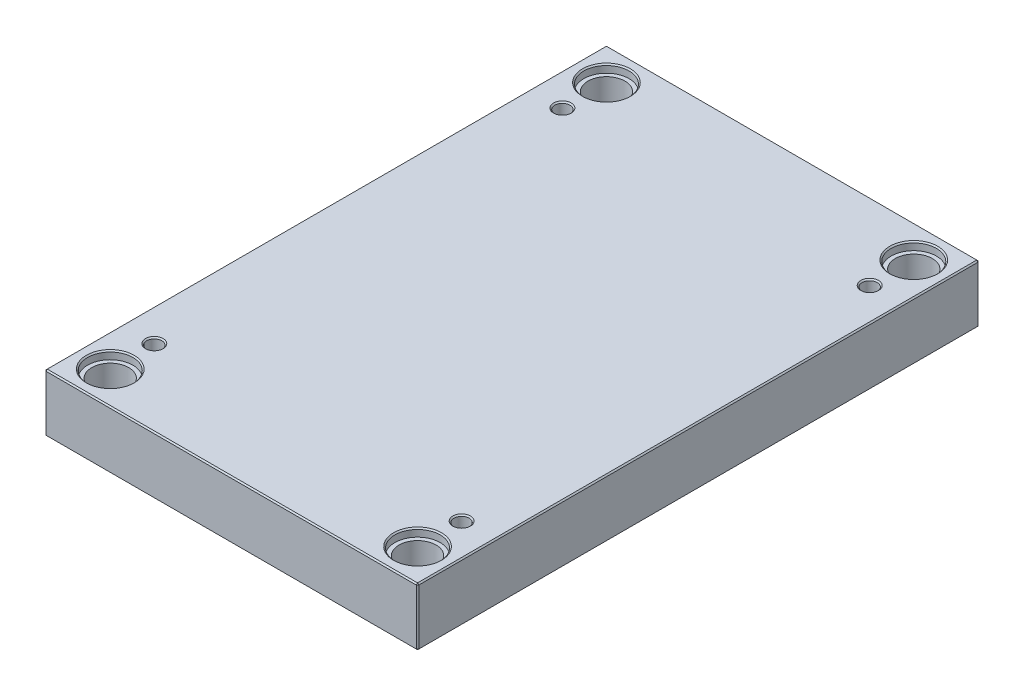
ISO-10303-21;
HEADER;
FILE_DESCRIPTION(('STEP AP214'),'2;1');
FILE_NAME('part.step','',(''),(''),'','','');
FILE_SCHEMA(('AUTOMOTIVE_DESIGN { 1 0 10303 214 1 1 1 1 }'));
ENDSEC;
DATA;
#1=APPLICATION_CONTEXT('core data for automotive mechanical design processes');
#2=APPLICATION_PROTOCOL_DEFINITION('international standard','automotive_design',2000,#1);
#3=PRODUCT_CONTEXT('',#1,'mechanical');
#4=PRODUCT('Part','Part','',(#3));
#5=PRODUCT_RELATED_PRODUCT_CATEGORY('part','',(#4));
#6=PRODUCT_DEFINITION_FORMATION('','',#4);
#7=PRODUCT_DEFINITION_CONTEXT('part definition',#1,'design');
#8=PRODUCT_DEFINITION('design','',#6,#7);
#9=PRODUCT_DEFINITION_SHAPE('','',#8);
#10=(LENGTH_UNIT() NAMED_UNIT(*) SI_UNIT(.MILLI.,.METRE.));
#11=(NAMED_UNIT(*) PLANE_ANGLE_UNIT() SI_UNIT($,.RADIAN.));
#12=(NAMED_UNIT(*) SI_UNIT($,.STERADIAN.) SOLID_ANGLE_UNIT());
#13=UNCERTAINTY_MEASURE_WITH_UNIT(LENGTH_MEASURE(1.E-05),#10,'distance_accuracy_value','');
#14=(GEOMETRIC_REPRESENTATION_CONTEXT(3) GLOBAL_UNCERTAINTY_ASSIGNED_CONTEXT((#13)) GLOBAL_UNIT_ASSIGNED_CONTEXT((#10,
#11,#12)) REPRESENTATION_CONTEXT('',''));
#15=CARTESIAN_POINT('',(0.,0.,0.));
#16=DIRECTION('',(0.,0.,1.));
#17=DIRECTION('',(1.,0.,0.));
#18=AXIS2_PLACEMENT_3D('',#15,#16,#17);
#19=CARTESIAN_POINT('',(-122.,0.,-197.));
#20=DIRECTION('',(0.,1.,0.));
#21=DIRECTION('',(0.,0.,1.));
#22=AXIS2_PLACEMENT_3D('',#19,#20,#21);
#23=CYLINDRICAL_SURFACE('',#22,14.7);
#24=CARTESIAN_POINT('',(-122.,0.999999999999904,-197.));
#25=DIRECTION('',(0.,1.,0.));
#26=DIRECTION('',(0.,0.,1.));
#27=AXIS2_PLACEMENT_3D('',#24,#25,#26);
#28=CIRCLE('',#27,14.7);
#29=CARTESIAN_POINT('',(-122.,0.999999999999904,-182.3));
#30=VERTEX_POINT('',#29);
#31=EDGE_CURVE('E471',#30,#30,#28,.F.);
#32=ORIENTED_EDGE('',*,*,#31,.T.);
#33=EDGE_LOOP('',(#32));
#34=FACE_BOUND('',#33,.T.);
#35=CARTESIAN_POINT('',(-122.,39.7,-197.));
#36=DIRECTION('',(0.,1.,0.));
#37=DIRECTION('',(0.,0.,1.));
#38=AXIS2_PLACEMENT_3D('',#35,#36,#37);
#39=CIRCLE('',#38,14.7);
#40=CARTESIAN_POINT('',(-122.,39.7,-182.3));
#41=VERTEX_POINT('',#40);
#42=EDGE_CURVE('E220',#41,#41,#39,.F.);
#43=ORIENTED_EDGE('',*,*,#42,.F.);
#44=EDGE_LOOP('',(#43));
#45=FACE_BOUND('',#44,.T.);
#46=ADVANCED_FACE('F15',(#34,#45),#23,.F.);
#47=CARTESIAN_POINT('',(122.,0.,-197.));
#48=DIRECTION('',(0.,1.,0.));
#49=DIRECTION('',(0.,0.,1.));
#50=AXIS2_PLACEMENT_3D('',#47,#48,#49);
#51=CYLINDRICAL_SURFACE('',#50,14.7);
#52=CARTESIAN_POINT('',(122.,0.999999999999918,-197.));
#53=DIRECTION('',(0.,1.,0.));
#54=DIRECTION('',(0.,0.,1.));
#55=AXIS2_PLACEMENT_3D('',#52,#53,#54);
#56=CIRCLE('',#55,14.7);
#57=CARTESIAN_POINT('',(122.,0.999999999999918,-182.3));
#58=VERTEX_POINT('',#57);
#59=EDGE_CURVE('E473',#58,#58,#56,.F.);
#60=ORIENTED_EDGE('',*,*,#59,.T.);
#61=EDGE_LOOP('',(#60));
#62=FACE_BOUND('',#61,.T.);
#63=CARTESIAN_POINT('',(122.,39.7,-197.));
#64=DIRECTION('',(0.,1.,0.));
#65=DIRECTION('',(0.,0.,1.));
#66=AXIS2_PLACEMENT_3D('',#63,#64,#65);
#67=CIRCLE('',#66,14.7);
#68=CARTESIAN_POINT('',(122.,39.7,-182.3));
#69=VERTEX_POINT('',#68);
#70=EDGE_CURVE('E217',#69,#69,#67,.F.);
#71=ORIENTED_EDGE('',*,*,#70,.F.);
#72=EDGE_LOOP('',(#71));
#73=FACE_BOUND('',#72,.T.);
#74=ADVANCED_FACE('F262',(#62,#73),#51,.F.);
#75=CARTESIAN_POINT('',(122.,0.,197.));
#76=DIRECTION('',(0.,1.,0.));
#77=DIRECTION('',(0.,0.,1.));
#78=AXIS2_PLACEMENT_3D('',#75,#76,#77);
#79=CYLINDRICAL_SURFACE('',#78,14.7);
#80=CARTESIAN_POINT('',(122.,0.999999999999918,197.));
#81=DIRECTION('',(0.,1.,0.));
#82=DIRECTION('',(0.,0.,1.));
#83=AXIS2_PLACEMENT_3D('',#80,#81,#82);
#84=CIRCLE('',#83,14.7);
#85=CARTESIAN_POINT('',(122.,0.999999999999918,211.7));
#86=VERTEX_POINT('',#85);
#87=EDGE_CURVE('E476',#86,#86,#84,.F.);
#88=ORIENTED_EDGE('',*,*,#87,.T.);
#89=EDGE_LOOP('',(#88));
#90=FACE_BOUND('',#89,.T.);
#91=CARTESIAN_POINT('',(122.,39.7,197.));
#92=DIRECTION('',(0.,1.,0.));
#93=DIRECTION('',(0.,0.,1.));
#94=AXIS2_PLACEMENT_3D('',#91,#92,#93);
#95=CIRCLE('',#94,14.7);
#96=CARTESIAN_POINT('',(122.,39.7,211.7));
#97=VERTEX_POINT('',#96);
#98=EDGE_CURVE('E213',#97,#97,#95,.F.);
#99=ORIENTED_EDGE('',*,*,#98,.F.);
#100=EDGE_LOOP('',(#99));
#101=FACE_BOUND('',#100,.T.);
#102=ADVANCED_FACE('F269',(#90,#101),#79,.F.);
#103=CARTESIAN_POINT('',(-122.,0.,197.));
#104=DIRECTION('',(0.,1.,0.));
#105=DIRECTION('',(0.,0.,1.));
#106=AXIS2_PLACEMENT_3D('',#103,#104,#105);
#107=CYLINDRICAL_SURFACE('',#106,14.7);
#108=CARTESIAN_POINT('',(-122.,1.00000000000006,197.));
#109=DIRECTION('',(0.,1.,0.));
#110=DIRECTION('',(0.,0.,1.));
#111=AXIS2_PLACEMENT_3D('',#108,#109,#110);
#112=CIRCLE('',#111,14.7);
#113=CARTESIAN_POINT('',(-122.,1.00000000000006,211.7));
#114=VERTEX_POINT('',#113);
#115=EDGE_CURVE('E479',#114,#114,#112,.F.);
#116=ORIENTED_EDGE('',*,*,#115,.T.);
#117=EDGE_LOOP('',(#116));
#118=FACE_BOUND('',#117,.T.);
#119=CARTESIAN_POINT('',(-122.,39.7,197.));
#120=DIRECTION('',(0.,1.,0.));
#121=DIRECTION('',(0.,0.,1.));
#122=AXIS2_PLACEMENT_3D('',#119,#120,#121);
#123=CIRCLE('',#122,14.7);
#124=CARTESIAN_POINT('',(-122.,39.7,211.7));
#125=VERTEX_POINT('',#124);
#126=EDGE_CURVE('E210',#125,#125,#123,.F.);
#127=ORIENTED_EDGE('',*,*,#126,.F.);
#128=EDGE_LOOP('',(#127));
#129=FACE_BOUND('',#128,.T.);
#130=ADVANCED_FACE('F276',(#118,#129),#107,.F.);
#131=CARTESIAN_POINT('',(-148.,46.,223.));
#132=DIRECTION('',(1.,0.,0.));
#133=DIRECTION('',(0.,0.,-1.));
#134=AXIS2_PLACEMENT_3D('',#131,#132,#133);
#135=PLANE('',#134);
#136=DIRECTION('',(0.,-1.,0.));
#137=VECTOR('',#136,1.);
#138=CARTESIAN_POINT('',(-148.,46.,-222.));
#139=LINE('',#138,#137);
#140=CARTESIAN_POINT('',(-148.,45.,-222.));
#141=VERTEX_POINT('',#140);
#142=CARTESIAN_POINT('',(-148.,1.,-222.));
#143=VERTEX_POINT('',#142);
#144=EDGE_CURVE('E486',#141,#143,#139,.T.);
#145=ORIENTED_EDGE('',*,*,#144,.T.);
#146=DIRECTION('',(0.,0.,1.));
#147=VECTOR('',#146,1.);
#148=CARTESIAN_POINT('',(-148.,1.,223.));
#149=LINE('',#148,#147);
#150=CARTESIAN_POINT('',(-148.,1.,222.));
#151=VERTEX_POINT('',#150);
#152=EDGE_CURVE('E489',#143,#151,#149,.T.);
#153=ORIENTED_EDGE('',*,*,#152,.T.);
#154=DIRECTION('',(0.,1.,0.));
#155=VECTOR('',#154,1.);
#156=CARTESIAN_POINT('',(-148.,46.,222.));
#157=LINE('',#156,#155);
#158=CARTESIAN_POINT('',(-148.,45.,222.));
#159=VERTEX_POINT('',#158);
#160=EDGE_CURVE('E484',#151,#159,#157,.T.);
#161=ORIENTED_EDGE('',*,*,#160,.T.);
#162=DIRECTION('',(0.,0.,-1.));
#163=VECTOR('',#162,1.);
#164=CARTESIAN_POINT('',(-148.,45.,-223.));
#165=LINE('',#164,#163);
#166=EDGE_CURVE('E482',#159,#141,#165,.T.);
#167=ORIENTED_EDGE('',*,*,#166,.T.);
#168=EDGE_LOOP('',(#145,#153,#161,#167));
#169=FACE_BOUND('',#168,.T.);
#170=ADVANCED_FACE('F297',(#169),#135,.F.);
#171=CARTESIAN_POINT('',(148.,46.,223.));
#172=DIRECTION('',(0.,0.,-1.));
#173=DIRECTION('',(-1.,0.,0.));
#174=AXIS2_PLACEMENT_3D('',#171,#172,#173);
#175=PLANE('',#174);
#176=DIRECTION('',(-1.,0.,0.));
#177=VECTOR('',#176,1.);
#178=CARTESIAN_POINT('',(-148.,45.,223.));
#179=LINE('',#178,#177);
#180=CARTESIAN_POINT('',(147.,45.,223.));
#181=VERTEX_POINT('',#180);
#182=CARTESIAN_POINT('',(-147.,45.,223.));
#183=VERTEX_POINT('',#182);
#184=EDGE_CURVE('E508',#181,#183,#179,.T.);
#185=ORIENTED_EDGE('',*,*,#184,.T.);
#186=DIRECTION('',(0.,-1.,0.));
#187=VECTOR('',#186,1.);
#188=CARTESIAN_POINT('',(-147.,46.,223.));
#189=LINE('',#188,#187);
#190=CARTESIAN_POINT('',(-147.,0.999999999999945,223.));
#191=VERTEX_POINT('',#190);
#192=EDGE_CURVE('E514',#183,#191,#189,.T.);
#193=ORIENTED_EDGE('',*,*,#192,.T.);
#194=DIRECTION('',(1.,0.,0.));
#195=VECTOR('',#194,1.);
#196=CARTESIAN_POINT('',(148.,0.999999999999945,223.));
#197=LINE('',#196,#195);
#198=CARTESIAN_POINT('',(147.,0.999999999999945,223.));
#199=VERTEX_POINT('',#198);
#200=EDGE_CURVE('E512',#191,#199,#197,.T.);
#201=ORIENTED_EDGE('',*,*,#200,.T.);
#202=DIRECTION('',(0.,1.,0.));
#203=VECTOR('',#202,1.);
#204=CARTESIAN_POINT('',(147.,46.,223.));
#205=LINE('',#204,#203);
#206=EDGE_CURVE('E510',#199,#181,#205,.T.);
#207=ORIENTED_EDGE('',*,*,#206,.T.);
#208=EDGE_LOOP('',(#185,#193,#201,#207));
#209=FACE_BOUND('',#208,.T.);
#210=ADVANCED_FACE('F293',(#209),#175,.F.);
#211=CARTESIAN_POINT('',(148.,46.,223.));
#212=DIRECTION('',(-1.,0.,0.));
#213=DIRECTION('',(0.,0.,1.));
#214=AXIS2_PLACEMENT_3D('',#211,#212,#213);
#215=PLANE('',#214);
#216=DIRECTION('',(0.,0.,-1.));
#217=VECTOR('',#216,1.);
#218=CARTESIAN_POINT('',(148.,0.999999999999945,223.));
#219=LINE('',#218,#217);
#220=CARTESIAN_POINT('',(148.,0.999999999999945,222.));
#221=VERTEX_POINT('',#220);
#222=CARTESIAN_POINT('',(148.,0.999999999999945,-222.));
#223=VERTEX_POINT('',#222);
#224=EDGE_CURVE('E503',#221,#223,#219,.T.);
#225=ORIENTED_EDGE('',*,*,#224,.T.);
#226=DIRECTION('',(0.,1.,0.));
#227=VECTOR('',#226,1.);
#228=CARTESIAN_POINT('',(148.,46.,-222.));
#229=LINE('',#228,#227);
#230=CARTESIAN_POINT('',(148.,45.,-222.));
#231=VERTEX_POINT('',#230);
#232=EDGE_CURVE('E505',#223,#231,#229,.T.);
#233=ORIENTED_EDGE('',*,*,#232,.T.);
#234=DIRECTION('',(0.,0.,1.));
#235=VECTOR('',#234,1.);
#236=CARTESIAN_POINT('',(148.,45.,223.));
#237=LINE('',#236,#235);
#238=CARTESIAN_POINT('',(148.,45.,222.));
#239=VERTEX_POINT('',#238);
#240=EDGE_CURVE('E499',#231,#239,#237,.T.);
#241=ORIENTED_EDGE('',*,*,#240,.T.);
#242=DIRECTION('',(0.,-1.,0.));
#243=VECTOR('',#242,1.);
#244=CARTESIAN_POINT('',(148.,46.,222.));
#245=LINE('',#244,#243);
#246=EDGE_CURVE('E501',#239,#221,#245,.T.);
#247=ORIENTED_EDGE('',*,*,#246,.T.);
#248=EDGE_LOOP('',(#225,#233,#241,#247));
#249=FACE_BOUND('',#248,.T.);
#250=ADVANCED_FACE('F289',(#249),#215,.F.);
#251=CARTESIAN_POINT('',(148.,46.,-223.));
#252=DIRECTION('',(0.,0.,1.));
#253=DIRECTION('',(1.,0.,0.));
#254=AXIS2_PLACEMENT_3D('',#251,#252,#253);
#255=PLANE('',#254);
#256=DIRECTION('',(0.,-1.,0.));
#257=VECTOR('',#256,1.);
#258=CARTESIAN_POINT('',(147.,46.,-223.));
#259=LINE('',#258,#257);
#260=CARTESIAN_POINT('',(147.,45.,-223.));
#261=VERTEX_POINT('',#260);
#262=CARTESIAN_POINT('',(147.,0.999999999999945,-223.));
#263=VERTEX_POINT('',#262);
#264=EDGE_CURVE('E493',#261,#263,#259,.T.);
#265=ORIENTED_EDGE('',*,*,#264,.T.);
#266=DIRECTION('',(-1.,0.,0.));
#267=VECTOR('',#266,1.);
#268=CARTESIAN_POINT('',(148.,0.999999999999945,-223.));
#269=LINE('',#268,#267);
#270=CARTESIAN_POINT('',(-147.,0.999999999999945,-223.));
#271=VERTEX_POINT('',#270);
#272=EDGE_CURVE('E137',#263,#271,#269,.T.);
#273=ORIENTED_EDGE('',*,*,#272,.T.);
#274=DIRECTION('',(0.,1.,0.));
#275=VECTOR('',#274,1.);
#276=CARTESIAN_POINT('',(-147.,46.,-223.));
#277=LINE('',#276,#275);
#278=CARTESIAN_POINT('',(-147.,45.,-223.));
#279=VERTEX_POINT('',#278);
#280=EDGE_CURVE('E495',#271,#279,#277,.T.);
#281=ORIENTED_EDGE('',*,*,#280,.T.);
#282=DIRECTION('',(1.,0.,0.));
#283=VECTOR('',#282,1.);
#284=CARTESIAN_POINT('',(148.,45.,-223.));
#285=LINE('',#284,#283);
#286=EDGE_CURVE('E491',#279,#261,#285,.T.);
#287=ORIENTED_EDGE('',*,*,#286,.T.);
#288=EDGE_LOOP('',(#265,#273,#281,#287));
#289=FACE_BOUND('',#288,.T.);
#290=ADVANCED_FACE('F281',(#289),#255,.F.);
#291=CARTESIAN_POINT('',(0.,46.,0.));
#292=DIRECTION('',(0.,1.,0.));
#293=DIRECTION('',(0.,0.,1.));
#294=AXIS2_PLACEMENT_3D('',#291,#292,#293);
#295=PLANE('',#294);
#296=CARTESIAN_POINT('',(122.,46.,197.));
#297=DIRECTION('',(0.,1.,0.));
#298=DIRECTION('',(0.,0.,1.));
#299=AXIS2_PLACEMENT_3D('',#296,#297,#298);
#300=CIRCLE('',#299,19.);
#301=CARTESIAN_POINT('',(122.,46.,216.));
#302=VERTEX_POINT('',#301);
#303=EDGE_CURVE('E235',#302,#302,#300,.F.);
#304=ORIENTED_EDGE('',*,*,#303,.T.);
#305=EDGE_LOOP('',(#304));
#306=FACE_BOUND('',#305,.T.);
#307=CARTESIAN_POINT('',(-122.,46.,197.));
#308=DIRECTION('',(0.,1.,0.));
#309=DIRECTION('',(0.,0.,1.));
#310=AXIS2_PLACEMENT_3D('',#307,#308,#309);
#311=CIRCLE('',#310,19.);
#312=CARTESIAN_POINT('',(-122.,46.,216.));
#313=VERTEX_POINT('',#312);
#314=EDGE_CURVE('E232',#313,#313,#311,.F.);
#315=ORIENTED_EDGE('',*,*,#314,.T.);
#316=EDGE_LOOP('',(#315));
#317=FACE_BOUND('',#316,.T.);
#318=CARTESIAN_POINT('',(122.,46.,-197.));
#319=DIRECTION('',(0.,1.,0.));
#320=DIRECTION('',(0.,0.,1.));
#321=AXIS2_PLACEMENT_3D('',#318,#319,#320);
#322=CIRCLE('',#321,19.);
#323=CARTESIAN_POINT('',(122.,46.,-178.));
#324=VERTEX_POINT('',#323);
#325=EDGE_CURVE('E229',#324,#324,#322,.F.);
#326=ORIENTED_EDGE('',*,*,#325,.T.);
#327=EDGE_LOOP('',(#326));
#328=FACE_BOUND('',#327,.T.);
#329=CARTESIAN_POINT('',(-122.,46.,-197.));
#330=DIRECTION('',(0.,1.,0.));
#331=DIRECTION('',(0.,0.,1.));
#332=AXIS2_PLACEMENT_3D('',#329,#330,#331);
#333=CIRCLE('',#332,19.);
#334=CARTESIAN_POINT('',(-122.,46.,-178.));
#335=VERTEX_POINT('',#334);
#336=EDGE_CURVE('E226',#335,#335,#333,.F.);
#337=ORIENTED_EDGE('',*,*,#336,.T.);
#338=EDGE_LOOP('',(#337));
#339=FACE_BOUND('',#338,.T.);
#340=CARTESIAN_POINT('',(-122.,46.,162.));
#341=DIRECTION('',(0.,1.,0.));
#342=DIRECTION('',(0.,0.,1.));
#343=AXIS2_PLACEMENT_3D('',#340,#341,#342);
#344=CIRCLE('',#343,7.);
#345=CARTESIAN_POINT('',(-122.,46.,169.));
#346=VERTEX_POINT('',#345);
#347=EDGE_CURVE('E197',#346,#346,#344,.F.);
#348=ORIENTED_EDGE('',*,*,#347,.T.);
#349=EDGE_LOOP('',(#348));
#350=FACE_BOUND('',#349,.T.);
#351=CARTESIAN_POINT('',(122.,46.,162.));
#352=DIRECTION('',(0.,1.,0.));
#353=DIRECTION('',(0.,0.,1.));
#354=AXIS2_PLACEMENT_3D('',#351,#352,#353);
#355=CIRCLE('',#354,7.00000000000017);
#356=CARTESIAN_POINT('',(122.,46.,169.));
#357=VERTEX_POINT('',#356);
#358=EDGE_CURVE('E194',#357,#357,#355,.F.);
#359=ORIENTED_EDGE('',*,*,#358,.T.);
#360=EDGE_LOOP('',(#359));
#361=FACE_BOUND('',#360,.T.);
#362=CARTESIAN_POINT('',(122.,46.,-162.));
#363=DIRECTION('',(0.,1.,0.));
#364=DIRECTION('',(0.,0.,1.));
#365=AXIS2_PLACEMENT_3D('',#362,#363,#364);
#366=CIRCLE('',#365,7.00000000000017);
#367=CARTESIAN_POINT('',(122.,46.,-155.));
#368=VERTEX_POINT('',#367);
#369=EDGE_CURVE('E191',#368,#368,#366,.F.);
#370=ORIENTED_EDGE('',*,*,#369,.T.);
#371=EDGE_LOOP('',(#370));
#372=FACE_BOUND('',#371,.T.);
#373=CARTESIAN_POINT('',(-122.,46.,-162.));
#374=DIRECTION('',(0.,1.,0.));
#375=DIRECTION('',(0.,0.,1.));
#376=AXIS2_PLACEMENT_3D('',#373,#374,#375);
#377=CIRCLE('',#376,7.);
#378=CARTESIAN_POINT('',(-122.,46.,-155.));
#379=VERTEX_POINT('',#378);
#380=EDGE_CURVE('E187',#379,#379,#377,.F.);
#381=ORIENTED_EDGE('',*,*,#380,.T.);
#382=EDGE_LOOP('',(#381));
#383=FACE_BOUND('',#382,.T.);
#384=DIRECTION('',(0.,0.,-1.));
#385=VECTOR('',#384,1.);
#386=CARTESIAN_POINT('',(147.,46.,-223.));
#387=LINE('',#386,#385);
#388=CARTESIAN_POINT('',(147.,46.,222.));
#389=VERTEX_POINT('',#388);
#390=CARTESIAN_POINT('',(147.,46.,-222.));
#391=VERTEX_POINT('',#390);
#392=EDGE_CURVE('E30',#389,#391,#387,.T.);
#393=ORIENTED_EDGE('',*,*,#392,.T.);
#394=DIRECTION('',(-1.,0.,0.));
#395=VECTOR('',#394,1.);
#396=CARTESIAN_POINT('',(-148.,46.,-222.));
#397=LINE('',#396,#395);
#398=CARTESIAN_POINT('',(-147.,46.,-222.));
#399=VERTEX_POINT('',#398);
#400=EDGE_CURVE('E188',#391,#399,#397,.T.);
#401=ORIENTED_EDGE('',*,*,#400,.T.);
#402=DIRECTION('',(0.,0.,1.));
#403=VECTOR('',#402,1.);
#404=CARTESIAN_POINT('',(-147.,46.,223.));
#405=LINE('',#404,#403);
#406=CARTESIAN_POINT('',(-147.,46.,222.));
#407=VERTEX_POINT('',#406);
#408=EDGE_CURVE('E517',#399,#407,#405,.T.);
#409=ORIENTED_EDGE('',*,*,#408,.T.);
#410=DIRECTION('',(1.,0.,0.));
#411=VECTOR('',#410,1.);
#412=CARTESIAN_POINT('',(148.,46.,222.));
#413=LINE('',#412,#411);
#414=EDGE_CURVE('E35',#407,#389,#413,.T.);
#415=ORIENTED_EDGE('',*,*,#414,.T.);
#416=EDGE_LOOP('',(#393,#401,#409,#415));
#417=FACE_BOUND('',#416,.T.);
#418=ADVANCED_FACE('F278',(#306,#317,#328,#339,#350,#361,#372,#383,#417),#295,.T.);
#419=CARTESIAN_POINT('',(0.,0.,0.));
#420=DIRECTION('',(0.,1.,0.));
#421=DIRECTION('',(0.,0.,1.));
#422=AXIS2_PLACEMENT_3D('',#419,#420,#421);
#423=PLANE('',#422);
#424=CARTESIAN_POINT('',(-122.,0.,-197.));
#425=DIRECTION('',(0.,1.,0.));
#426=DIRECTION('',(0.,0.,1.));
#427=AXIS2_PLACEMENT_3D('',#424,#425,#426);
#428=CIRCLE('',#427,15.7);
#429=CARTESIAN_POINT('',(-122.,0.,-181.3));
#430=VERTEX_POINT('',#429);
#431=EDGE_CURVE('E468',#430,#430,#428,.T.);
#432=ORIENTED_EDGE('',*,*,#431,.T.);
#433=EDGE_LOOP('',(#432));
#434=FACE_BOUND('',#433,.T.);
#435=CARTESIAN_POINT('',(122.,0.,-197.));
#436=DIRECTION('',(0.,1.,0.));
#437=DIRECTION('',(0.,0.,1.));
#438=AXIS2_PLACEMENT_3D('',#435,#436,#437);
#439=CIRCLE('',#438,15.7);
#440=CARTESIAN_POINT('',(122.,0.,-181.3));
#441=VERTEX_POINT('',#440);
#442=EDGE_CURVE('E465',#441,#441,#439,.T.);
#443=ORIENTED_EDGE('',*,*,#442,.T.);
#444=EDGE_LOOP('',(#443));
#445=FACE_BOUND('',#444,.T.);
#446=CARTESIAN_POINT('',(122.,0.,197.));
#447=DIRECTION('',(0.,1.,0.));
#448=DIRECTION('',(0.,0.,1.));
#449=AXIS2_PLACEMENT_3D('',#446,#447,#448);
#450=CIRCLE('',#449,15.7);
#451=CARTESIAN_POINT('',(122.,0.,212.7));
#452=VERTEX_POINT('',#451);
#453=EDGE_CURVE('E462',#452,#452,#450,.T.);
#454=ORIENTED_EDGE('',*,*,#453,.T.);
#455=EDGE_LOOP('',(#454));
#456=FACE_BOUND('',#455,.T.);
#457=CARTESIAN_POINT('',(-122.,0.,197.));
#458=DIRECTION('',(0.,1.,0.));
#459=DIRECTION('',(0.,0.,1.));
#460=AXIS2_PLACEMENT_3D('',#457,#458,#459);
#461=CIRCLE('',#460,15.7);
#462=CARTESIAN_POINT('',(-122.,0.,212.7));
#463=VERTEX_POINT('',#462);
#464=EDGE_CURVE('E459',#463,#463,#461,.T.);
#465=ORIENTED_EDGE('',*,*,#464,.T.);
#466=EDGE_LOOP('',(#465));
#467=FACE_BOUND('',#466,.T.);
#468=DIRECTION('',(0.,0.,1.));
#469=VECTOR('',#468,1.);
#470=CARTESIAN_POINT('',(147.,0.,0.));
#471=LINE('',#470,#469);
#472=CARTESIAN_POINT('',(147.,0.,-222.));
#473=VERTEX_POINT('',#472);
#474=CARTESIAN_POINT('',(147.,0.,222.));
#475=VERTEX_POINT('',#474);
#476=EDGE_CURVE('E107',#473,#475,#471,.T.);
#477=ORIENTED_EDGE('',*,*,#476,.T.);
#478=DIRECTION('',(-1.,0.,0.));
#479=VECTOR('',#478,1.);
#480=CARTESIAN_POINT('',(0.,0.,222.));
#481=LINE('',#480,#479);
#482=CARTESIAN_POINT('',(-147.,0.,222.));
#483=VERTEX_POINT('',#482);
#484=EDGE_CURVE('E457',#475,#483,#481,.T.);
#485=ORIENTED_EDGE('',*,*,#484,.T.);
#486=DIRECTION('',(0.,0.,-1.));
#487=VECTOR('',#486,1.);
#488=CARTESIAN_POINT('',(-147.,0.,0.));
#489=LINE('',#488,#487);
#490=CARTESIAN_POINT('',(-147.,0.,-222.));
#491=VERTEX_POINT('',#490);
#492=EDGE_CURVE('E109',#483,#491,#489,.T.);
#493=ORIENTED_EDGE('',*,*,#492,.T.);
#494=DIRECTION('',(1.,0.,0.));
#495=VECTOR('',#494,1.);
#496=CARTESIAN_POINT('',(0.,0.,-222.));
#497=LINE('',#496,#495);
#498=EDGE_CURVE('E103',#491,#473,#497,.T.);
#499=ORIENTED_EDGE('',*,*,#498,.T.);
#500=EDGE_LOOP('',(#477,#485,#493,#499));
#501=FACE_BOUND('',#500,.T.);
#502=ADVANCED_FACE('F105',(#434,#445,#456,#467,#501),#423,.F.);
#503=CARTESIAN_POINT('',(-122.,0.,-197.));
#504=DIRECTION('',(0.,-1.,0.));
#505=DIRECTION('',(0.,0.,-1.));
#506=AXIS2_PLACEMENT_3D('',#503,#504,#505);
#507=CONICAL_SURFACE('',#506,15.7,0.785398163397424);
#508=ORIENTED_EDGE('',*,*,#31,.F.);
#509=EDGE_LOOP('',(#508));
#510=FACE_BOUND('',#509,.T.);
#511=ORIENTED_EDGE('',*,*,#431,.F.);
#512=EDGE_LOOP('',(#511));
#513=FACE_BOUND('',#512,.T.);
#514=ADVANCED_FACE('F285',(#510,#513),#507,.F.);
#515=CARTESIAN_POINT('',(122.,0.,-197.));
#516=DIRECTION('',(0.,-1.,0.));
#517=DIRECTION('',(0.,0.,-1.));
#518=AXIS2_PLACEMENT_3D('',#515,#516,#517);
#519=CONICAL_SURFACE('',#518,15.7,0.785398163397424);
#520=ORIENTED_EDGE('',*,*,#59,.F.);
#521=EDGE_LOOP('',(#520));
#522=FACE_BOUND('',#521,.T.);
#523=ORIENTED_EDGE('',*,*,#442,.F.);
#524=EDGE_LOOP('',(#523));
#525=FACE_BOUND('',#524,.T.);
#526=ADVANCED_FACE('F304',(#522,#525),#519,.F.);
#527=CARTESIAN_POINT('',(122.,0.,197.));
#528=DIRECTION('',(0.,-1.,0.));
#529=DIRECTION('',(0.,0.,-1.));
#530=AXIS2_PLACEMENT_3D('',#527,#528,#529);
#531=CONICAL_SURFACE('',#530,15.7,0.785398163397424);
#532=ORIENTED_EDGE('',*,*,#87,.F.);
#533=EDGE_LOOP('',(#532));
#534=FACE_BOUND('',#533,.T.);
#535=ORIENTED_EDGE('',*,*,#453,.F.);
#536=EDGE_LOOP('',(#535));
#537=FACE_BOUND('',#536,.T.);
#538=ADVANCED_FACE('F308',(#534,#537),#531,.F.);
#539=CARTESIAN_POINT('',(-122.,0.,197.));
#540=DIRECTION('',(0.,-1.,0.));
#541=DIRECTION('',(0.,0.,-1.));
#542=AXIS2_PLACEMENT_3D('',#539,#540,#541);
#543=CONICAL_SURFACE('',#542,15.7,0.785398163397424);
#544=ORIENTED_EDGE('',*,*,#115,.F.);
#545=EDGE_LOOP('',(#544));
#546=FACE_BOUND('',#545,.T.);
#547=ORIENTED_EDGE('',*,*,#464,.F.);
#548=EDGE_LOOP('',(#547));
#549=FACE_BOUND('',#548,.T.);
#550=ADVANCED_FACE('F312',(#546,#549),#543,.F.);
#551=CARTESIAN_POINT('',(148.,46.,222.));
#552=DIRECTION('',(-0.707106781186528,0.,-0.707106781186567));
#553=DIRECTION('',(0.,-1.,0.));
#554=AXIS2_PLACEMENT_3D('',#551,#552,#553);
#555=PLANE('',#554);
#556=DIRECTION('',(-0.707106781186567,0.,0.707106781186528));
#557=VECTOR('',#556,1.);
#558=CARTESIAN_POINT('',(147.,45.,223.));
#559=LINE('',#558,#557);
#560=EDGE_CURVE('E125',#181,#239,#559,.F.);
#561=ORIENTED_EDGE('',*,*,#560,.F.);
#562=ORIENTED_EDGE('',*,*,#206,.F.);
#563=DIRECTION('',(0.707106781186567,0.,-0.707106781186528));
#564=VECTOR('',#563,1.);
#565=CARTESIAN_POINT('',(147.,0.999999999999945,223.));
#566=LINE('',#565,#564);
#567=EDGE_CURVE('E179',#221,#199,#566,.F.);
#568=ORIENTED_EDGE('',*,*,#567,.F.);
#569=ORIENTED_EDGE('',*,*,#246,.F.);
#570=EDGE_LOOP('',(#561,#562,#568,#569));
#571=FACE_BOUND('',#570,.T.);
#572=ADVANCED_FACE('F316',(#571),#555,.F.);
#573=CARTESIAN_POINT('',(147.,45.,223.));
#574=DIRECTION('',(0.577350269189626,0.577350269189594,0.577350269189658));
#575=DIRECTION('',(0.707106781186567,0.,-0.707106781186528));
#576=AXIS2_PLACEMENT_3D('',#573,#574,#575);
#577=PLANE('',#576);
#578=DIRECTION('',(0.,-0.707106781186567,0.707106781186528));
#579=VECTOR('',#578,1.);
#580=CARTESIAN_POINT('',(147.,45.,223.));
#581=LINE('',#580,#579);
#582=EDGE_CURVE('E174',#181,#389,#581,.F.);
#583=ORIENTED_EDGE('',*,*,#582,.F.);
#584=ORIENTED_EDGE('',*,*,#560,.T.);
#585=DIRECTION('',(-0.707106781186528,0.707106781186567,0.));
#586=VECTOR('',#585,1.);
#587=CARTESIAN_POINT('',(147.5,45.5,222.));
#588=LINE('',#587,#586);
#589=EDGE_CURVE('E176',#389,#239,#588,.F.);
#590=ORIENTED_EDGE('',*,*,#589,.F.);
#591=EDGE_LOOP('',(#583,#584,#590));
#592=FACE_BOUND('',#591,.T.);
#593=ADVANCED_FACE('F384',(#592),#577,.T.);
#594=CARTESIAN_POINT('',(147.,0.999999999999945,223.));
#595=DIRECTION('',(0.577350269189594,-0.577350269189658,0.577350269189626));
#596=DIRECTION('',(0.,-0.707106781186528,-0.707106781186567));
#597=AXIS2_PLACEMENT_3D('',#594,#595,#596);
#598=PLANE('',#597);
#599=DIRECTION('',(-0.707106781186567,-0.707106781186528,0.));
#600=VECTOR('',#599,1.);
#601=CARTESIAN_POINT('',(147.5,0.499999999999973,222.));
#602=LINE('',#601,#600);
#603=EDGE_CURVE('E123',#221,#475,#602,.T.);
#604=ORIENTED_EDGE('',*,*,#603,.F.);
#605=ORIENTED_EDGE('',*,*,#567,.T.);
#606=DIRECTION('',(0.,0.707106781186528,0.707106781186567));
#607=VECTOR('',#606,1.);
#608=CARTESIAN_POINT('',(147.,0.999999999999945,223.));
#609=LINE('',#608,#607);
#610=EDGE_CURVE('E171',#475,#199,#609,.T.);
#611=ORIENTED_EDGE('',*,*,#610,.F.);
#612=EDGE_LOOP('',(#604,#605,#611));
#613=FACE_BOUND('',#612,.T.);
#614=ADVANCED_FACE('F380',(#613),#598,.T.);
#615=CARTESIAN_POINT('',(147.,46.,0.));
#616=DIRECTION('',(0.707106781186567,0.707106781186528,0.));
#617=DIRECTION('',(0.,0.,1.));
#618=AXIS2_PLACEMENT_3D('',#615,#616,#617);
#619=PLANE('',#618);
#620=ORIENTED_EDGE('',*,*,#589,.T.);
#621=ORIENTED_EDGE('',*,*,#240,.F.);
#622=DIRECTION('',(0.707106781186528,-0.707106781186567,0.));
#623=VECTOR('',#622,1.);
#624=CARTESIAN_POINT('',(148.,45.,-222.));
#625=LINE('',#624,#623);
#626=EDGE_CURVE('E165',#391,#231,#625,.T.);
#627=ORIENTED_EDGE('',*,*,#626,.F.);
#628=ORIENTED_EDGE('',*,*,#392,.F.);
#629=EDGE_LOOP('',(#620,#621,#627,#628));
#630=FACE_BOUND('',#629,.T.);
#631=ADVANCED_FACE('F376',(#630),#619,.T.);
#632=CARTESIAN_POINT('',(0.,46.,222.));
#633=DIRECTION('',(0.,0.707106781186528,0.707106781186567));
#634=DIRECTION('',(-1.,0.,0.));
#635=AXIS2_PLACEMENT_3D('',#632,#633,#634);
#636=PLANE('',#635);
#637=ORIENTED_EDGE('',*,*,#582,.T.);
#638=ORIENTED_EDGE('',*,*,#414,.F.);
#639=DIRECTION('',(0.,0.707106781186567,-0.707106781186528));
#640=VECTOR('',#639,1.);
#641=CARTESIAN_POINT('',(-147.,45.5,222.5));
#642=LINE('',#641,#640);
#643=EDGE_CURVE('E162',#183,#407,#642,.T.);
#644=ORIENTED_EDGE('',*,*,#643,.F.);
#645=ORIENTED_EDGE('',*,*,#184,.F.);
#646=EDGE_LOOP('',(#637,#638,#644,#645));
#647=FACE_BOUND('',#646,.T.);
#648=ADVANCED_FACE('F372',(#647),#636,.T.);
#649=CARTESIAN_POINT('',(-147.,46.,223.));
#650=DIRECTION('',(0.707106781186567,0.,-0.707106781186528));
#651=DIRECTION('',(0.,-1.,0.));
#652=AXIS2_PLACEMENT_3D('',#649,#650,#651);
#653=PLANE('',#652);
#654=DIRECTION('',(0.707106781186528,0.,0.707106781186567));
#655=VECTOR('',#654,1.);
#656=CARTESIAN_POINT('',(-147.,0.999999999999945,223.));
#657=LINE('',#656,#655);
#658=EDGE_CURVE('E156',#191,#151,#657,.F.);
#659=ORIENTED_EDGE('',*,*,#658,.F.);
#660=ORIENTED_EDGE('',*,*,#192,.F.);
#661=DIRECTION('',(-0.707106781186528,0.,-0.707106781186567));
#662=VECTOR('',#661,1.);
#663=CARTESIAN_POINT('',(-148.,45.,222.));
#664=LINE('',#663,#662);
#665=EDGE_CURVE('E159',#159,#183,#664,.F.);
#666=ORIENTED_EDGE('',*,*,#665,.F.);
#667=ORIENTED_EDGE('',*,*,#160,.F.);
#668=EDGE_LOOP('',(#659,#660,#666,#667));
#669=FACE_BOUND('',#668,.T.);
#670=ADVANCED_FACE('F368',(#669),#653,.F.);
#671=CARTESIAN_POINT('',(148.,0.999999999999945,223.));
#672=DIRECTION('',(0.,0.707106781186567,-0.707106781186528));
#673=DIRECTION('',(1.,0.,0.));
#674=AXIS2_PLACEMENT_3D('',#671,#672,#673);
#675=PLANE('',#674);
#676=ORIENTED_EDGE('',*,*,#610,.T.);
#677=ORIENTED_EDGE('',*,*,#200,.F.);
#678=DIRECTION('',(0.,-0.707106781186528,-0.707106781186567));
#679=VECTOR('',#678,1.);
#680=CARTESIAN_POINT('',(-147.,0.999999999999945,223.));
#681=LINE('',#680,#679);
#682=EDGE_CURVE('E134',#483,#191,#681,.F.);
#683=ORIENTED_EDGE('',*,*,#682,.F.);
#684=ORIENTED_EDGE('',*,*,#484,.F.);
#685=EDGE_LOOP('',(#676,#677,#683,#684));
#686=FACE_BOUND('',#685,.T.);
#687=ADVANCED_FACE('F365',(#686),#675,.F.);
#688=CARTESIAN_POINT('',(148.,0.999999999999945,223.));
#689=DIRECTION('',(-0.707106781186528,0.707106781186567,0.));
#690=DIRECTION('',(0.,0.,-1.));
#691=AXIS2_PLACEMENT_3D('',#688,#689,#690);
#692=PLANE('',#691);
#693=ORIENTED_EDGE('',*,*,#603,.T.);
#694=ORIENTED_EDGE('',*,*,#476,.F.);
#695=DIRECTION('',(0.707106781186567,0.707106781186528,0.));
#696=VECTOR('',#695,1.);
#697=CARTESIAN_POINT('',(147.5,0.499999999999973,-222.));
#698=LINE('',#697,#696);
#699=EDGE_CURVE('E120',#223,#473,#698,.F.);
#700=ORIENTED_EDGE('',*,*,#699,.F.);
#701=ORIENTED_EDGE('',*,*,#224,.F.);
#702=EDGE_LOOP('',(#693,#694,#700,#701));
#703=FACE_BOUND('',#702,.T.);
#704=ADVANCED_FACE('F118',(#703),#692,.F.);
#705=CARTESIAN_POINT('',(147.,46.,-223.));
#706=DIRECTION('',(-0.707106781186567,0.,0.707106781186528));
#707=DIRECTION('',(0.,-1.,0.));
#708=AXIS2_PLACEMENT_3D('',#705,#706,#707);
#709=PLANE('',#708);
#710=DIRECTION('',(0.707106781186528,0.,0.707106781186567));
#711=VECTOR('',#710,1.);
#712=CARTESIAN_POINT('',(148.,45.,-222.));
#713=LINE('',#712,#711);
#714=EDGE_CURVE('E167',#231,#261,#713,.F.);
#715=ORIENTED_EDGE('',*,*,#714,.F.);
#716=ORIENTED_EDGE('',*,*,#232,.F.);
#717=DIRECTION('',(-0.707106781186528,0.,-0.707106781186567));
#718=VECTOR('',#717,1.);
#719=CARTESIAN_POINT('',(147.,0.999999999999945,-223.));
#720=LINE('',#719,#718);
#721=EDGE_CURVE('E133',#263,#223,#720,.F.);
#722=ORIENTED_EDGE('',*,*,#721,.F.);
#723=ORIENTED_EDGE('',*,*,#264,.F.);
#724=EDGE_LOOP('',(#715,#716,#722,#723));
#725=FACE_BOUND('',#724,.T.);
#726=ADVANCED_FACE('F358',(#725),#709,.F.);
#727=CARTESIAN_POINT('',(148.,45.,-222.));
#728=DIRECTION('',(0.577350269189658,0.577350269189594,-0.577350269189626));
#729=DIRECTION('',(-0.707106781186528,0.,-0.707106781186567));
#730=AXIS2_PLACEMENT_3D('',#727,#728,#729);
#731=PLANE('',#730);
#732=ORIENTED_EDGE('',*,*,#626,.T.);
#733=ORIENTED_EDGE('',*,*,#714,.T.);
#734=DIRECTION('',(0.,0.707106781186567,0.707106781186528));
#735=VECTOR('',#734,1.);
#736=CARTESIAN_POINT('',(147.,45.5,-222.5));
#737=LINE('',#736,#735);
#738=EDGE_CURVE('E151',#391,#261,#737,.F.);
#739=ORIENTED_EDGE('',*,*,#738,.F.);
#740=EDGE_LOOP('',(#732,#733,#739));
#741=FACE_BOUND('',#740,.T.);
#742=ADVANCED_FACE('F354',(#741),#731,.T.);
#743=CARTESIAN_POINT('',(-148.,45.,222.));
#744=DIRECTION('',(-0.577350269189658,0.577350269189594,0.577350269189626));
#745=DIRECTION('',(0.707106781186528,0.,0.707106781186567));
#746=AXIS2_PLACEMENT_3D('',#743,#744,#745);
#747=PLANE('',#746);
#748=ORIENTED_EDGE('',*,*,#665,.T.);
#749=ORIENTED_EDGE('',*,*,#643,.T.);
#750=DIRECTION('',(-0.707106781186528,-0.707106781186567,0.));
#751=VECTOR('',#750,1.);
#752=CARTESIAN_POINT('',(-148.,45.,222.));
#753=LINE('',#752,#751);
#754=EDGE_CURVE('E142',#159,#407,#753,.F.);
#755=ORIENTED_EDGE('',*,*,#754,.F.);
#756=EDGE_LOOP('',(#748,#749,#755));
#757=FACE_BOUND('',#756,.T.);
#758=ADVANCED_FACE('F350',(#757),#747,.T.);
#759=CARTESIAN_POINT('',(-147.,0.999999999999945,223.));
#760=DIRECTION('',(-0.577350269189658,-0.577350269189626,0.577350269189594));
#761=DIRECTION('',(0.707106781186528,-0.707106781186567,0.));
#762=AXIS2_PLACEMENT_3D('',#759,#760,#761);
#763=PLANE('',#762);
#764=ORIENTED_EDGE('',*,*,#682,.T.);
#765=ORIENTED_EDGE('',*,*,#658,.T.);
#766=DIRECTION('',(-0.707106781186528,0.707106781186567,0.));
#767=VECTOR('',#766,1.);
#768=CARTESIAN_POINT('',(-147.5,0.5,222.));
#769=LINE('',#768,#767);
#770=EDGE_CURVE('E138',#483,#151,#769,.T.);
#771=ORIENTED_EDGE('',*,*,#770,.F.);
#772=EDGE_LOOP('',(#764,#765,#771));
#773=FACE_BOUND('',#772,.T.);
#774=ADVANCED_FACE('F347',(#773),#763,.T.);
#775=CARTESIAN_POINT('',(147.,0.999999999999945,-223.));
#776=DIRECTION('',(0.577350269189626,-0.577350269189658,-0.577350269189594));
#777=DIRECTION('',(0.707106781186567,0.707106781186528,0.));
#778=AXIS2_PLACEMENT_3D('',#775,#776,#777);
#779=PLANE('',#778);
#780=ORIENTED_EDGE('',*,*,#721,.T.);
#781=ORIENTED_EDGE('',*,*,#699,.T.);
#782=DIRECTION('',(0.,-0.707106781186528,0.707106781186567));
#783=VECTOR('',#782,1.);
#784=CARTESIAN_POINT('',(147.,0.999999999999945,-223.));
#785=LINE('',#784,#783);
#786=EDGE_CURVE('E130',#263,#473,#785,.T.);
#787=ORIENTED_EDGE('',*,*,#786,.F.);
#788=EDGE_LOOP('',(#780,#781,#787));
#789=FACE_BOUND('',#788,.T.);
#790=ADVANCED_FACE('F129',(#789),#779,.T.);
#791=CARTESIAN_POINT('',(0.,46.,-222.));
#792=DIRECTION('',(0.,0.707106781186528,-0.707106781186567));
#793=DIRECTION('',(1.,0.,0.));
#794=AXIS2_PLACEMENT_3D('',#791,#792,#793);
#795=PLANE('',#794);
#796=ORIENTED_EDGE('',*,*,#738,.T.);
#797=ORIENTED_EDGE('',*,*,#286,.F.);
#798=DIRECTION('',(0.,-0.707106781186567,-0.707106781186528));
#799=VECTOR('',#798,1.);
#800=CARTESIAN_POINT('',(-147.,45.,-223.));
#801=LINE('',#800,#799);
#802=EDGE_CURVE('E139',#399,#279,#801,.T.);
#803=ORIENTED_EDGE('',*,*,#802,.F.);
#804=ORIENTED_EDGE('',*,*,#400,.F.);
#805=EDGE_LOOP('',(#796,#797,#803,#804));
#806=FACE_BOUND('',#805,.T.);
#807=ADVANCED_FACE('F340',(#806),#795,.T.);
#808=CARTESIAN_POINT('',(-147.,46.,0.));
#809=DIRECTION('',(-0.707106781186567,0.707106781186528,0.));
#810=DIRECTION('',(0.,0.,-1.));
#811=AXIS2_PLACEMENT_3D('',#808,#809,#810);
#812=PLANE('',#811);
#813=ORIENTED_EDGE('',*,*,#754,.T.);
#814=ORIENTED_EDGE('',*,*,#408,.F.);
#815=DIRECTION('',(0.707106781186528,0.707106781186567,0.));
#816=VECTOR('',#815,1.);
#817=CARTESIAN_POINT('',(-147.5,45.5,-222.));
#818=LINE('',#817,#816);
#819=EDGE_CURVE('E145',#141,#399,#818,.T.);
#820=ORIENTED_EDGE('',*,*,#819,.F.);
#821=ORIENTED_EDGE('',*,*,#166,.F.);
#822=EDGE_LOOP('',(#813,#814,#820,#821));
#823=FACE_BOUND('',#822,.T.);
#824=ADVANCED_FACE('F336',(#823),#812,.T.);
#825=CARTESIAN_POINT('',(-148.,1.,223.));
#826=DIRECTION('',(0.707106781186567,0.707106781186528,0.));
#827=DIRECTION('',(0.,0.,1.));
#828=AXIS2_PLACEMENT_3D('',#825,#826,#827);
#829=PLANE('',#828);
#830=ORIENTED_EDGE('',*,*,#770,.T.);
#831=ORIENTED_EDGE('',*,*,#152,.F.);
#832=DIRECTION('',(0.707106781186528,-0.707106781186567,0.));
#833=VECTOR('',#832,1.);
#834=CARTESIAN_POINT('',(-148.,1.,-222.));
#835=LINE('',#834,#833);
#836=EDGE_CURVE('E528',#491,#143,#835,.F.);
#837=ORIENTED_EDGE('',*,*,#836,.F.);
#838=ORIENTED_EDGE('',*,*,#492,.F.);
#839=EDGE_LOOP('',(#830,#831,#837,#838));
#840=FACE_BOUND('',#839,.T.);
#841=ADVANCED_FACE('F333',(#840),#829,.F.);
#842=CARTESIAN_POINT('',(148.,0.999999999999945,-223.));
#843=DIRECTION('',(0.,0.707106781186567,0.707106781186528));
#844=DIRECTION('',(-1.,0.,0.));
#845=AXIS2_PLACEMENT_3D('',#842,#843,#844);
#846=PLANE('',#845);
#847=ORIENTED_EDGE('',*,*,#786,.T.);
#848=ORIENTED_EDGE('',*,*,#498,.F.);
#849=DIRECTION('',(0.,0.707106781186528,-0.707106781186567));
#850=VECTOR('',#849,1.);
#851=CARTESIAN_POINT('',(-147.,0.499999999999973,-222.5));
#852=LINE('',#851,#850);
#853=EDGE_CURVE('E525',#271,#491,#852,.F.);
#854=ORIENTED_EDGE('',*,*,#853,.F.);
#855=ORIENTED_EDGE('',*,*,#272,.F.);
#856=EDGE_LOOP('',(#847,#848,#854,#855));
#857=FACE_BOUND('',#856,.T.);
#858=ADVANCED_FACE('F136',(#857),#846,.F.);
#859=CARTESIAN_POINT('',(-147.,45.,-223.));
#860=DIRECTION('',(-0.577350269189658,0.577350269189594,-0.577350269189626));
#861=DIRECTION('',(-0.707106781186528,0.,0.707106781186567));
#862=AXIS2_PLACEMENT_3D('',#859,#860,#861);
#863=PLANE('',#862);
#864=ORIENTED_EDGE('',*,*,#819,.T.);
#865=ORIENTED_EDGE('',*,*,#802,.T.);
#866=DIRECTION('',(0.707106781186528,0.,-0.707106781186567));
#867=VECTOR('',#866,1.);
#868=CARTESIAN_POINT('',(-147.,45.,-223.));
#869=LINE('',#868,#867);
#870=EDGE_CURVE('E523',#141,#279,#869,.T.);
#871=ORIENTED_EDGE('',*,*,#870,.F.);
#872=EDGE_LOOP('',(#864,#865,#871));
#873=FACE_BOUND('',#872,.T.);
#874=ADVANCED_FACE('F326',(#873),#863,.T.);
#875=CARTESIAN_POINT('',(-148.,1.,-222.));
#876=DIRECTION('',(-0.577350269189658,-0.577350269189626,-0.577350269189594));
#877=DIRECTION('',(0.707106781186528,-0.707106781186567,0.));
#878=AXIS2_PLACEMENT_3D('',#875,#876,#877);
#879=PLANE('',#878);
#880=ORIENTED_EDGE('',*,*,#853,.T.);
#881=ORIENTED_EDGE('',*,*,#836,.T.);
#882=DIRECTION('',(-0.707106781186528,0.,0.707106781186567));
#883=VECTOR('',#882,1.);
#884=CARTESIAN_POINT('',(-148.,1.,-222.));
#885=LINE('',#884,#883);
#886=EDGE_CURVE('E454',#271,#143,#885,.T.);
#887=ORIENTED_EDGE('',*,*,#886,.F.);
#888=EDGE_LOOP('',(#880,#881,#887));
#889=FACE_BOUND('',#888,.T.);
#890=ADVANCED_FACE('F322',(#889),#879,.T.);
#891=CARTESIAN_POINT('',(-148.,46.,-222.));
#892=DIRECTION('',(0.707106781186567,0.,0.707106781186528));
#893=DIRECTION('',(0.,-1.,0.));
#894=AXIS2_PLACEMENT_3D('',#891,#892,#893);
#895=PLANE('',#894);
#896=ORIENTED_EDGE('',*,*,#870,.T.);
#897=ORIENTED_EDGE('',*,*,#280,.F.);
#898=ORIENTED_EDGE('',*,*,#886,.T.);
#899=ORIENTED_EDGE('',*,*,#144,.F.);
#900=EDGE_LOOP('',(#896,#897,#898,#899));
#901=FACE_BOUND('',#900,.T.);
#902=ADVANCED_FACE('F318',(#901),#895,.F.);
#903=CARTESIAN_POINT('',(-122.,22.,-162.));
#904=DIRECTION('',(0.,1.,0.));
#905=DIRECTION('',(0.,0.,1.));
#906=AXIS2_PLACEMENT_3D('',#903,#904,#905);
#907=CYLINDRICAL_SURFACE('',#906,6.);
#908=CARTESIAN_POINT('',(-122.,45.,-162.));
#909=DIRECTION('',(0.,1.,0.));
#910=DIRECTION('',(0.,0.,1.));
#911=AXIS2_PLACEMENT_3D('',#908,#909,#910);
#912=CIRCLE('',#911,6.);
#913=CARTESIAN_POINT('',(-122.,45.,-156.));
#914=VERTEX_POINT('',#913);
#915=EDGE_CURVE('E206',#914,#914,#912,.T.);
#916=ORIENTED_EDGE('',*,*,#915,.T.);
#917=EDGE_LOOP('',(#916));
#918=FACE_BOUND('',#917,.T.);
#919=CARTESIAN_POINT('',(-122.,22.,-162.));
#920=DIRECTION('',(0.,1.,0.));
#921=DIRECTION('',(0.,0.,1.));
#922=AXIS2_PLACEMENT_3D('',#919,#920,#921);
#923=CIRCLE('',#922,6.);
#924=CARTESIAN_POINT('',(-122.,22.,-156.));
#925=VERTEX_POINT('',#924);
#926=EDGE_CURVE('E447',#925,#925,#923,.T.);
#927=ORIENTED_EDGE('',*,*,#926,.F.);
#928=EDGE_LOOP('',(#927));
#929=FACE_BOUND('',#928,.T.);
#930=ADVANCED_FACE('F321',(#918,#929),#907,.F.);
#931=CARTESIAN_POINT('',(-122.,22.,-162.));
#932=DIRECTION('',(0.,1.,0.));
#933=DIRECTION('',(0.,0.,1.));
#934=AXIS2_PLACEMENT_3D('',#931,#932,#933);
#935=PLANE('',#934);
#936=ORIENTED_EDGE('',*,*,#926,.T.);
#937=EDGE_LOOP('',(#936));
#938=FACE_BOUND('',#937,.T.);
#939=ADVANCED_FACE('F595',(#938),#935,.T.);
#940=CARTESIAN_POINT('',(122.,22.,-162.));
#941=DIRECTION('',(0.,1.,0.));
#942=DIRECTION('',(0.,0.,1.));
#943=AXIS2_PLACEMENT_3D('',#940,#941,#942);
#944=CYLINDRICAL_SURFACE('',#943,6.);
#945=CARTESIAN_POINT('',(122.,45.,-162.));
#946=DIRECTION('',(0.,1.,0.));
#947=DIRECTION('',(0.,0.,1.));
#948=AXIS2_PLACEMENT_3D('',#945,#946,#947);
#949=CIRCLE('',#948,6.);
#950=CARTESIAN_POINT('',(122.,45.,-156.));
#951=VERTEX_POINT('',#950);
#952=EDGE_CURVE('E203',#951,#951,#949,.T.);
#953=ORIENTED_EDGE('',*,*,#952,.T.);
#954=EDGE_LOOP('',(#953));
#955=FACE_BOUND('',#954,.T.);
#956=CARTESIAN_POINT('',(122.,22.,-162.));
#957=DIRECTION('',(0.,1.,0.));
#958=DIRECTION('',(0.,0.,1.));
#959=AXIS2_PLACEMENT_3D('',#956,#957,#958);
#960=CIRCLE('',#959,6.);
#961=CARTESIAN_POINT('',(122.,22.,-156.));
#962=VERTEX_POINT('',#961);
#963=EDGE_CURVE('E444',#962,#962,#960,.T.);
#964=ORIENTED_EDGE('',*,*,#963,.F.);
#965=EDGE_LOOP('',(#964));
#966=FACE_BOUND('',#965,.T.);
#967=ADVANCED_FACE('F591',(#955,#966),#944,.F.);
#968=CARTESIAN_POINT('',(122.,22.,-162.));
#969=DIRECTION('',(0.,1.,0.));
#970=DIRECTION('',(0.,0.,1.));
#971=AXIS2_PLACEMENT_3D('',#968,#969,#970);
#972=PLANE('',#971);
#973=ORIENTED_EDGE('',*,*,#963,.T.);
#974=EDGE_LOOP('',(#973));
#975=FACE_BOUND('',#974,.T.);
#976=ADVANCED_FACE('F587',(#975),#972,.T.);
#977=CARTESIAN_POINT('',(122.,22.,162.));
#978=DIRECTION('',(0.,1.,0.));
#979=DIRECTION('',(0.,0.,1.));
#980=AXIS2_PLACEMENT_3D('',#977,#978,#979);
#981=CYLINDRICAL_SURFACE('',#980,6.);
#982=CARTESIAN_POINT('',(122.,45.,162.));
#983=DIRECTION('',(0.,1.,0.));
#984=DIRECTION('',(0.,0.,1.));
#985=AXIS2_PLACEMENT_3D('',#982,#983,#984);
#986=CIRCLE('',#985,6.);
#987=CARTESIAN_POINT('',(122.,45.,168.));
#988=VERTEX_POINT('',#987);
#989=EDGE_CURVE('E200',#988,#988,#986,.T.);
#990=ORIENTED_EDGE('',*,*,#989,.T.);
#991=EDGE_LOOP('',(#990));
#992=FACE_BOUND('',#991,.T.);
#993=CARTESIAN_POINT('',(122.,22.,162.));
#994=DIRECTION('',(0.,1.,0.));
#995=DIRECTION('',(0.,0.,1.));
#996=AXIS2_PLACEMENT_3D('',#993,#994,#995);
#997=CIRCLE('',#996,6.);
#998=CARTESIAN_POINT('',(122.,22.,168.));
#999=VERTEX_POINT('',#998);
#1000=EDGE_CURVE('E448',#999,#999,#997,.T.);
#1001=ORIENTED_EDGE('',*,*,#1000,.F.);
#1002=EDGE_LOOP('',(#1001));
#1003=FACE_BOUND('',#1002,.T.);
#1004=ADVANCED_FACE('F590',(#992,#1003),#981,.F.);
#1005=CARTESIAN_POINT('',(122.,22.,162.));
#1006=DIRECTION('',(0.,1.,0.));
#1007=DIRECTION('',(0.,0.,1.));
#1008=AXIS2_PLACEMENT_3D('',#1005,#1006,#1007);
#1009=PLANE('',#1008);
#1010=ORIENTED_EDGE('',*,*,#1000,.T.);
#1011=EDGE_LOOP('',(#1010));
#1012=FACE_BOUND('',#1011,.T.);
#1013=ADVANCED_FACE('F597',(#1012),#1009,.T.);
#1014=CARTESIAN_POINT('',(-122.,22.,162.));
#1015=DIRECTION('',(0.,1.,0.));
#1016=DIRECTION('',(0.,0.,1.));
#1017=AXIS2_PLACEMENT_3D('',#1014,#1015,#1016);
#1018=CYLINDRICAL_SURFACE('',#1017,6.);
#1019=CARTESIAN_POINT('',(-122.,45.,162.));
#1020=DIRECTION('',(0.,1.,0.));
#1021=DIRECTION('',(0.,0.,1.));
#1022=AXIS2_PLACEMENT_3D('',#1019,#1020,#1021);
#1023=CIRCLE('',#1022,6.);
#1024=CARTESIAN_POINT('',(-122.,45.,168.));
#1025=VERTEX_POINT('',#1024);
#1026=EDGE_CURVE('E184',#1025,#1025,#1023,.T.);
#1027=ORIENTED_EDGE('',*,*,#1026,.T.);
#1028=EDGE_LOOP('',(#1027));
#1029=FACE_BOUND('',#1028,.T.);
#1030=CARTESIAN_POINT('',(-122.,22.,162.));
#1031=DIRECTION('',(0.,1.,0.));
#1032=DIRECTION('',(0.,0.,1.));
#1033=AXIS2_PLACEMENT_3D('',#1030,#1031,#1032);
#1034=CIRCLE('',#1033,6.);
#1035=CARTESIAN_POINT('',(-122.,22.,168.));
#1036=VERTEX_POINT('',#1035);
#1037=EDGE_CURVE('E223',#1036,#1036,#1034,.T.);
#1038=ORIENTED_EDGE('',*,*,#1037,.F.);
#1039=EDGE_LOOP('',(#1038));
#1040=FACE_BOUND('',#1039,.T.);
#1041=ADVANCED_FACE('F600',(#1029,#1040),#1018,.F.);
#1042=CARTESIAN_POINT('',(-122.,22.,162.));
#1043=DIRECTION('',(0.,1.,0.));
#1044=DIRECTION('',(0.,0.,1.));
#1045=AXIS2_PLACEMENT_3D('',#1042,#1043,#1044);
#1046=PLANE('',#1045);
#1047=ORIENTED_EDGE('',*,*,#1037,.T.);
#1048=EDGE_LOOP('',(#1047));
#1049=FACE_BOUND('',#1048,.T.);
#1050=ADVANCED_FACE('F396',(#1049),#1046,.T.);
#1051=CARTESIAN_POINT('',(-122.,45.,162.));
#1052=DIRECTION('',(0.,1.,0.));
#1053=DIRECTION('',(0.,0.,1.));
#1054=AXIS2_PLACEMENT_3D('',#1051,#1052,#1053);
#1055=CONICAL_SURFACE('',#1054,6.,0.785398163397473);
#1056=ORIENTED_EDGE('',*,*,#347,.F.);
#1057=EDGE_LOOP('',(#1056));
#1058=FACE_BOUND('',#1057,.T.);
#1059=ORIENTED_EDGE('',*,*,#1026,.F.);
#1060=EDGE_LOOP('',(#1059));
#1061=FACE_BOUND('',#1060,.T.);
#1062=ADVANCED_FACE('F392',(#1058,#1061),#1055,.F.);
#1063=CARTESIAN_POINT('',(122.,45.,162.));
#1064=DIRECTION('',(0.,1.,0.));
#1065=DIRECTION('',(0.,0.,1.));
#1066=AXIS2_PLACEMENT_3D('',#1063,#1064,#1065);
#1067=CONICAL_SURFACE('',#1066,6.,0.785398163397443);
#1068=ORIENTED_EDGE('',*,*,#358,.F.);
#1069=EDGE_LOOP('',(#1068));
#1070=FACE_BOUND('',#1069,.T.);
#1071=ORIENTED_EDGE('',*,*,#989,.F.);
#1072=EDGE_LOOP('',(#1071));
#1073=FACE_BOUND('',#1072,.T.);
#1074=ADVANCED_FACE('F395',(#1070,#1073),#1067,.F.);
#1075=CARTESIAN_POINT('',(122.,45.,-162.));
#1076=DIRECTION('',(0.,1.,0.));
#1077=DIRECTION('',(0.,0.,1.));
#1078=AXIS2_PLACEMENT_3D('',#1075,#1076,#1077);
#1079=CONICAL_SURFACE('',#1078,6.,0.785398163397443);
#1080=ORIENTED_EDGE('',*,*,#369,.F.);
#1081=EDGE_LOOP('',(#1080));
#1082=FACE_BOUND('',#1081,.T.);
#1083=ORIENTED_EDGE('',*,*,#952,.F.);
#1084=EDGE_LOOP('',(#1083));
#1085=FACE_BOUND('',#1084,.T.);
#1086=ADVANCED_FACE('F400',(#1082,#1085),#1079,.F.);
#1087=CARTESIAN_POINT('',(-122.,45.,-162.));
#1088=DIRECTION('',(0.,1.,0.));
#1089=DIRECTION('',(0.,0.,1.));
#1090=AXIS2_PLACEMENT_3D('',#1087,#1088,#1089);
#1091=CONICAL_SURFACE('',#1090,6.,0.785398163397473);
#1092=ORIENTED_EDGE('',*,*,#380,.F.);
#1093=EDGE_LOOP('',(#1092));
#1094=FACE_BOUND('',#1093,.T.);
#1095=ORIENTED_EDGE('',*,*,#915,.F.);
#1096=EDGE_LOOP('',(#1095));
#1097=FACE_BOUND('',#1096,.T.);
#1098=ADVANCED_FACE('F404',(#1094,#1097),#1091,.F.);
#1099=CARTESIAN_POINT('',(-122.,39.7,197.));
#1100=DIRECTION('',(0.,1.,0.));
#1101=DIRECTION('',(0.,0.,1.));
#1102=AXIS2_PLACEMENT_3D('',#1099,#1100,#1101);
#1103=PLANE('',#1102);
#1104=CARTESIAN_POINT('',(-122.,39.7,197.));
#1105=DIRECTION('',(0.,1.,0.));
#1106=DIRECTION('',(0.,0.,1.));
#1107=AXIS2_PLACEMENT_3D('',#1104,#1105,#1106);
#1108=CIRCLE('',#1107,18.);
#1109=CARTESIAN_POINT('',(-122.,39.7,215.));
#1110=VERTEX_POINT('',#1109);
#1111=EDGE_CURVE('E435',#1110,#1110,#1108,.T.);
#1112=ORIENTED_EDGE('',*,*,#1111,.T.);
#1113=EDGE_LOOP('',(#1112));
#1114=FACE_BOUND('',#1113,.T.);
#1115=ORIENTED_EDGE('',*,*,#126,.T.);
#1116=EDGE_LOOP('',(#1115));
#1117=FACE_BOUND('',#1116,.T.);
#1118=ADVANCED_FACE('F408',(#1114,#1117),#1103,.T.);
#1119=CARTESIAN_POINT('',(-122.,39.7,197.));
#1120=DIRECTION('',(0.,1.,0.));
#1121=DIRECTION('',(0.,0.,1.));
#1122=AXIS2_PLACEMENT_3D('',#1119,#1120,#1121);
#1123=CYLINDRICAL_SURFACE('',#1122,18.);
#1124=CARTESIAN_POINT('',(-122.,45.,197.));
#1125=DIRECTION('',(0.,1.,0.));
#1126=DIRECTION('',(0.,0.,1.));
#1127=AXIS2_PLACEMENT_3D('',#1124,#1125,#1126);
#1128=CIRCLE('',#1127,18.);
#1129=CARTESIAN_POINT('',(-122.,45.,215.));
#1130=VERTEX_POINT('',#1129);
#1131=EDGE_CURVE('E238',#1130,#1130,#1128,.T.);
#1132=ORIENTED_EDGE('',*,*,#1131,.T.);
#1133=EDGE_LOOP('',(#1132));
#1134=FACE_BOUND('',#1133,.T.);
#1135=ORIENTED_EDGE('',*,*,#1111,.F.);
#1136=EDGE_LOOP('',(#1135));
#1137=FACE_BOUND('',#1136,.T.);
#1138=ADVANCED_FACE('F573',(#1134,#1137),#1123,.F.);
#1139=CARTESIAN_POINT('',(122.,39.7,197.));
#1140=DIRECTION('',(0.,1.,0.));
#1141=DIRECTION('',(0.,0.,1.));
#1142=AXIS2_PLACEMENT_3D('',#1139,#1140,#1141);
#1143=PLANE('',#1142);
#1144=CARTESIAN_POINT('',(122.,39.7,197.));
#1145=DIRECTION('',(0.,1.,0.));
#1146=DIRECTION('',(0.,0.,1.));
#1147=AXIS2_PLACEMENT_3D('',#1144,#1145,#1146);
#1148=CIRCLE('',#1147,18.);
#1149=CARTESIAN_POINT('',(122.,39.7,215.));
#1150=VERTEX_POINT('',#1149);
#1151=EDGE_CURVE('E432',#1150,#1150,#1148,.T.);
#1152=ORIENTED_EDGE('',*,*,#1151,.T.);
#1153=EDGE_LOOP('',(#1152));
#1154=FACE_BOUND('',#1153,.T.);
#1155=ORIENTED_EDGE('',*,*,#98,.T.);
#1156=EDGE_LOOP('',(#1155));
#1157=FACE_BOUND('',#1156,.T.);
#1158=ADVANCED_FACE('F428',(#1154,#1157),#1143,.T.);
#1159=CARTESIAN_POINT('',(122.,39.7,197.));
#1160=DIRECTION('',(0.,1.,0.));
#1161=DIRECTION('',(0.,0.,1.));
#1162=AXIS2_PLACEMENT_3D('',#1159,#1160,#1161);
#1163=CYLINDRICAL_SURFACE('',#1162,18.);
#1164=CARTESIAN_POINT('',(122.,45.,197.));
#1165=DIRECTION('',(0.,1.,0.));
#1166=DIRECTION('',(0.,0.,1.));
#1167=AXIS2_PLACEMENT_3D('',#1164,#1165,#1166);
#1168=CIRCLE('',#1167,18.);
#1169=CARTESIAN_POINT('',(122.,45.,215.));
#1170=VERTEX_POINT('',#1169);
#1171=EDGE_CURVE('E209',#1170,#1170,#1168,.T.);
#1172=ORIENTED_EDGE('',*,*,#1171,.T.);
#1173=EDGE_LOOP('',(#1172));
#1174=FACE_BOUND('',#1173,.T.);
#1175=ORIENTED_EDGE('',*,*,#1151,.F.);
#1176=EDGE_LOOP('',(#1175));
#1177=FACE_BOUND('',#1176,.T.);
#1178=ADVANCED_FACE('F424',(#1174,#1177),#1163,.F.);
#1179=CARTESIAN_POINT('',(122.,39.7,-197.));
#1180=DIRECTION('',(0.,1.,0.));
#1181=DIRECTION('',(0.,0.,1.));
#1182=AXIS2_PLACEMENT_3D('',#1179,#1180,#1181);
#1183=PLANE('',#1182);
#1184=CARTESIAN_POINT('',(122.,39.7,-197.));
#1185=DIRECTION('',(0.,1.,0.));
#1186=DIRECTION('',(0.,0.,1.));
#1187=AXIS2_PLACEMENT_3D('',#1184,#1185,#1186);
#1188=CIRCLE('',#1187,18.);
#1189=CARTESIAN_POINT('',(122.,39.7,-179.));
#1190=VERTEX_POINT('',#1189);
#1191=EDGE_CURVE('E434',#1190,#1190,#1188,.T.);
#1192=ORIENTED_EDGE('',*,*,#1191,.T.);
#1193=EDGE_LOOP('',(#1192));
#1194=FACE_BOUND('',#1193,.T.);
#1195=ORIENTED_EDGE('',*,*,#70,.T.);
#1196=EDGE_LOOP('',(#1195));
#1197=FACE_BOUND('',#1196,.T.);
#1198=ADVANCED_FACE('F427',(#1194,#1197),#1183,.T.);
#1199=CARTESIAN_POINT('',(122.,39.7,-197.));
#1200=DIRECTION('',(0.,1.,0.));
#1201=DIRECTION('',(0.,0.,1.));
#1202=AXIS2_PLACEMENT_3D('',#1199,#1200,#1201);
#1203=CYLINDRICAL_SURFACE('',#1202,18.);
#1204=CARTESIAN_POINT('',(122.,45.,-197.));
#1205=DIRECTION('',(0.,1.,0.));
#1206=DIRECTION('',(0.,0.,1.));
#1207=AXIS2_PLACEMENT_3D('',#1204,#1205,#1206);
#1208=CIRCLE('',#1207,18.);
#1209=CARTESIAN_POINT('',(122.,45.,-179.));
#1210=VERTEX_POINT('',#1209);
#1211=EDGE_CURVE('E23',#1210,#1210,#1208,.T.);
#1212=ORIENTED_EDGE('',*,*,#1211,.T.);
#1213=EDGE_LOOP('',(#1212));
#1214=FACE_BOUND('',#1213,.T.);
#1215=ORIENTED_EDGE('',*,*,#1191,.F.);
#1216=EDGE_LOOP('',(#1215));
#1217=FACE_BOUND('',#1216,.T.);
#1218=ADVANCED_FACE('F243',(#1214,#1217),#1203,.F.);
#1219=CARTESIAN_POINT('',(-122.,39.7,-197.));
#1220=DIRECTION('',(0.,1.,0.));
#1221=DIRECTION('',(0.,0.,1.));
#1222=AXIS2_PLACEMENT_3D('',#1219,#1220,#1221);
#1223=PLANE('',#1222);
#1224=CARTESIAN_POINT('',(-122.,39.7,-197.));
#1225=DIRECTION('',(0.,1.,0.));
#1226=DIRECTION('',(0.,0.,1.));
#1227=AXIS2_PLACEMENT_3D('',#1224,#1225,#1226);
#1228=CIRCLE('',#1227,18.);
#1229=CARTESIAN_POINT('',(-122.,39.7,-179.));
#1230=VERTEX_POINT('',#1229);
#1231=EDGE_CURVE('E214',#1230,#1230,#1228,.T.);
#1232=ORIENTED_EDGE('',*,*,#1231,.T.);
#1233=EDGE_LOOP('',(#1232));
#1234=FACE_BOUND('',#1233,.T.);
#1235=ORIENTED_EDGE('',*,*,#42,.T.);
#1236=EDGE_LOOP('',(#1235));
#1237=FACE_BOUND('',#1236,.T.);
#1238=ADVANCED_FACE('F417',(#1234,#1237),#1223,.T.);
#1239=CARTESIAN_POINT('',(-122.,39.7,-197.));
#1240=DIRECTION('',(0.,1.,0.));
#1241=DIRECTION('',(0.,0.,1.));
#1242=AXIS2_PLACEMENT_3D('',#1239,#1240,#1241);
#1243=CYLINDRICAL_SURFACE('',#1242,18.);
#1244=CARTESIAN_POINT('',(-122.,45.,-197.));
#1245=DIRECTION('',(0.,1.,0.));
#1246=DIRECTION('',(0.,0.,1.));
#1247=AXIS2_PLACEMENT_3D('',#1244,#1245,#1246);
#1248=CIRCLE('',#1247,18.);
#1249=CARTESIAN_POINT('',(-122.,45.,-179.));
#1250=VERTEX_POINT('',#1249);
#1251=EDGE_CURVE('E9',#1250,#1250,#1248,.T.);
#1252=ORIENTED_EDGE('',*,*,#1251,.T.);
#1253=EDGE_LOOP('',(#1252));
#1254=FACE_BOUND('',#1253,.T.);
#1255=ORIENTED_EDGE('',*,*,#1231,.F.);
#1256=EDGE_LOOP('',(#1255));
#1257=FACE_BOUND('',#1256,.T.);
#1258=ADVANCED_FACE('F411',(#1254,#1257),#1243,.F.);
#1259=CARTESIAN_POINT('',(122.,45.,197.));
#1260=DIRECTION('',(0.,1.,0.));
#1261=DIRECTION('',(0.,0.,1.));
#1262=AXIS2_PLACEMENT_3D('',#1259,#1260,#1261);
#1263=CONICAL_SURFACE('',#1262,18.,0.785398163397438);
#1264=ORIENTED_EDGE('',*,*,#303,.F.);
#1265=EDGE_LOOP('',(#1264));
#1266=FACE_BOUND('',#1265,.T.);
#1267=ORIENTED_EDGE('',*,*,#1171,.F.);
#1268=EDGE_LOOP('',(#1267));
#1269=FACE_BOUND('',#1268,.T.);
#1270=ADVANCED_FACE('F257',(#1266,#1269),#1263,.F.);
#1271=CARTESIAN_POINT('',(-122.,45.,197.));
#1272=DIRECTION('',(0.,1.,0.));
#1273=DIRECTION('',(0.,0.,1.));
#1274=AXIS2_PLACEMENT_3D('',#1271,#1272,#1273);
#1275=CONICAL_SURFACE('',#1274,18.,0.785398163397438);
#1276=ORIENTED_EDGE('',*,*,#314,.F.);
#1277=EDGE_LOOP('',(#1276));
#1278=FACE_BOUND('',#1277,.T.);
#1279=ORIENTED_EDGE('',*,*,#1131,.F.);
#1280=EDGE_LOOP('',(#1279));
#1281=FACE_BOUND('',#1280,.T.);
#1282=ADVANCED_FACE('F248',(#1278,#1281),#1275,.F.);
#1283=CARTESIAN_POINT('',(122.,45.,-197.));
#1284=DIRECTION('',(0.,1.,0.));
#1285=DIRECTION('',(0.,0.,1.));
#1286=AXIS2_PLACEMENT_3D('',#1283,#1284,#1285);
#1287=CONICAL_SURFACE('',#1286,18.,0.785398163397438);
#1288=ORIENTED_EDGE('',*,*,#325,.F.);
#1289=EDGE_LOOP('',(#1288));
#1290=FACE_BOUND('',#1289,.T.);
#1291=ORIENTED_EDGE('',*,*,#1211,.F.);
#1292=EDGE_LOOP('',(#1291));
#1293=FACE_BOUND('',#1292,.T.);
#1294=ADVANCED_FACE('F246',(#1290,#1293),#1287,.F.);
#1295=CARTESIAN_POINT('',(-122.,45.,-197.));
#1296=DIRECTION('',(0.,1.,0.));
#1297=DIRECTION('',(0.,0.,1.));
#1298=AXIS2_PLACEMENT_3D('',#1295,#1296,#1297);
#1299=CONICAL_SURFACE('',#1298,18.,0.785398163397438);
#1300=ORIENTED_EDGE('',*,*,#336,.F.);
#1301=EDGE_LOOP('',(#1300));
#1302=FACE_BOUND('',#1301,.T.);
#1303=ORIENTED_EDGE('',*,*,#1251,.F.);
#1304=EDGE_LOOP('',(#1303));
#1305=FACE_BOUND('',#1304,.T.);
#1306=ADVANCED_FACE('F17',(#1302,#1305),#1299,.F.);
#1307=CLOSED_SHELL('',(#46,#74,#102,#130,#170,#210,#250,#290,#418,#502,#514,#526,#538,#550,#572,
#593,#614,#631,#648,#670,#687,#704,#726,#742,#758,#774,#790,#807,#824,#841,#858,#874,#890,#902,
#930,#939,#967,#976,#1004,#1013,#1041,#1050,#1062,#1074,#1086,#1098,#1118,#1138,#1158,#1178,
#1198,#1218,#1238,#1258,#1270,#1282,#1294,#1306));
#1308=MANIFOLD_SOLID_BREP('B1',#1307);
#1309=ADVANCED_BREP_SHAPE_REPRESENTATION('',(#18,#1308),#14);
#1310=SHAPE_DEFINITION_REPRESENTATION(#9,#1309);
ENDSEC;
END-ISO-10303-21;
